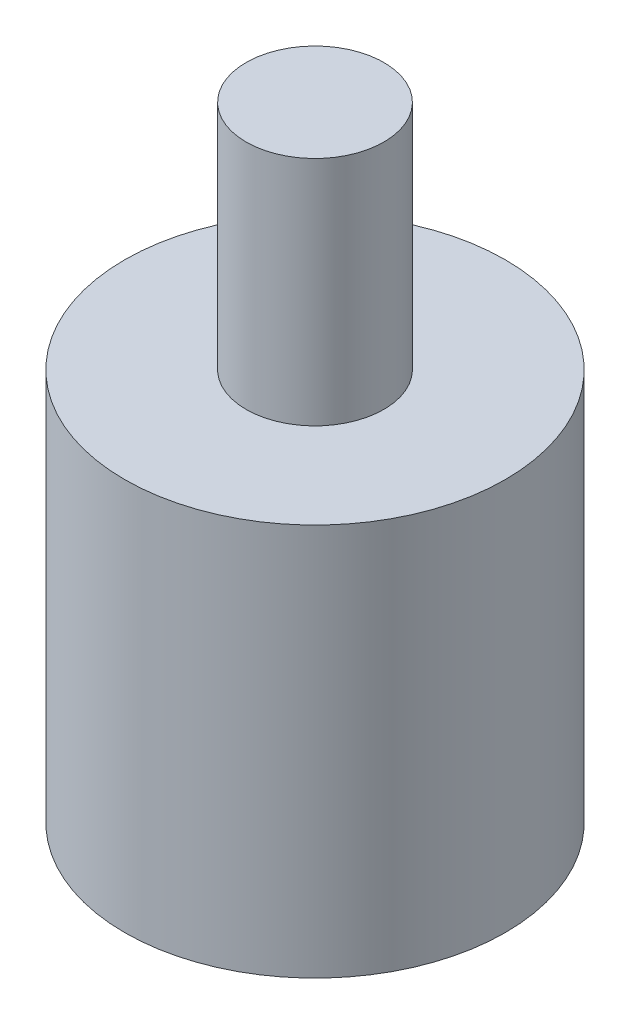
ISO-10303-21;
HEADER;
FILE_DESCRIPTION(('STEP AP214'),'2;1');
FILE_NAME('part.step','',(''),(''),'','','');
FILE_SCHEMA(('AUTOMOTIVE_DESIGN { 1 0 10303 214 1 1 1 1 }'));
ENDSEC;
DATA;
#1=APPLICATION_CONTEXT('core data for automotive mechanical design processes');
#2=APPLICATION_PROTOCOL_DEFINITION('international standard','automotive_design',2000,#1);
#3=PRODUCT_CONTEXT('',#1,'mechanical');
#4=PRODUCT('Part','Part','',(#3));
#5=PRODUCT_RELATED_PRODUCT_CATEGORY('part','',(#4));
#6=PRODUCT_DEFINITION_FORMATION('','',#4);
#7=PRODUCT_DEFINITION_CONTEXT('part definition',#1,'design');
#8=PRODUCT_DEFINITION('design','',#6,#7);
#9=PRODUCT_DEFINITION_SHAPE('','',#8);
#10=(LENGTH_UNIT() NAMED_UNIT(*) SI_UNIT(.MILLI.,.METRE.));
#11=(NAMED_UNIT(*) PLANE_ANGLE_UNIT() SI_UNIT($,.RADIAN.));
#12=(NAMED_UNIT(*) SI_UNIT($,.STERADIAN.) SOLID_ANGLE_UNIT());
#13=UNCERTAINTY_MEASURE_WITH_UNIT(LENGTH_MEASURE(1.E-05),#10,'distance_accuracy_value','');
#14=(GEOMETRIC_REPRESENTATION_CONTEXT(3) GLOBAL_UNCERTAINTY_ASSIGNED_CONTEXT((#13)) GLOBAL_UNIT_ASSIGNED_CONTEXT((#10,
#11,#12)) REPRESENTATION_CONTEXT('',''));
#15=CARTESIAN_POINT('',(0.,0.,0.));
#16=DIRECTION('',(0.,0.,1.));
#17=DIRECTION('',(1.,0.,0.));
#18=AXIS2_PLACEMENT_3D('',#15,#16,#17);
#19=CARTESIAN_POINT('',(0.,20.5,0.));
#20=DIRECTION('',(0.,-1.,0.));
#21=DIRECTION('',(0.,0.,-1.));
#22=AXIS2_PLACEMENT_3D('',#19,#20,#21);
#23=CYLINDRICAL_SURFACE('',#22,9.945);
#24=CARTESIAN_POINT('',(0.,20.5,0.));
#25=DIRECTION('',(0.,1.,0.));
#26=DIRECTION('',(0.,0.,1.));
#27=AXIS2_PLACEMENT_3D('',#24,#25,#26);
#28=CIRCLE('',#27,9.945);
#29=CARTESIAN_POINT('',(0.,20.5,9.945));
#30=VERTEX_POINT('',#29);
#31=EDGE_CURVE('E51',#30,#30,#28,.T.);
#32=ORIENTED_EDGE('',*,*,#31,.F.);
#33=EDGE_LOOP('',(#32));
#34=FACE_BOUND('',#33,.T.);
#35=CARTESIAN_POINT('',(0.,0.,0.));
#36=DIRECTION('',(0.,1.,0.));
#37=DIRECTION('',(0.,0.,1.));
#38=AXIS2_PLACEMENT_3D('',#35,#36,#37);
#39=CIRCLE('',#38,9.945);
#40=CARTESIAN_POINT('',(0.,0.,9.945));
#41=VERTEX_POINT('',#40);
#42=EDGE_CURVE('E46',#41,#41,#39,.T.);
#43=ORIENTED_EDGE('',*,*,#42,.T.);
#44=EDGE_LOOP('',(#43));
#45=FACE_BOUND('',#44,.T.);
#46=ADVANCED_FACE('F43',(#34,#45),#23,.T.);
#47=CARTESIAN_POINT('',(0.,20.5,0.));
#48=DIRECTION('',(0.,1.,0.));
#49=DIRECTION('',(0.,0.,1.));
#50=AXIS2_PLACEMENT_3D('',#47,#48,#49);
#51=PLANE('',#50);
#52=CARTESIAN_POINT('',(0.,20.5,0.));
#53=DIRECTION('',(0.,1.,0.));
#54=DIRECTION('',(0.,0.,1.));
#55=AXIS2_PLACEMENT_3D('',#52,#53,#54);
#56=CIRCLE('',#55,3.6);
#57=CARTESIAN_POINT('',(0.,20.5,3.6));
#58=VERTEX_POINT('',#57);
#59=EDGE_CURVE('E10',#58,#58,#56,.T.);
#60=ORIENTED_EDGE('',*,*,#59,.F.);
#61=EDGE_LOOP('',(#60));
#62=FACE_BOUND('',#61,.T.);
#63=ORIENTED_EDGE('',*,*,#31,.T.);
#64=EDGE_LOOP('',(#63));
#65=FACE_BOUND('',#64,.T.);
#66=ADVANCED_FACE('F71',(#62,#65),#51,.T.);
#67=CARTESIAN_POINT('',(0.,0.,0.));
#68=DIRECTION('',(0.,1.,0.));
#69=DIRECTION('',(0.,0.,1.));
#70=AXIS2_PLACEMENT_3D('',#67,#68,#69);
#71=PLANE('',#70);
#72=ORIENTED_EDGE('',*,*,#42,.F.);
#73=EDGE_LOOP('',(#72));
#74=FACE_BOUND('',#73,.T.);
#75=ADVANCED_FACE('F68',(#74),#71,.F.);
#76=CARTESIAN_POINT('',(0.,32.6,0.));
#77=DIRECTION('',(0.,-1.,0.));
#78=DIRECTION('',(0.,0.,-1.));
#79=AXIS2_PLACEMENT_3D('',#76,#77,#78);
#80=CYLINDRICAL_SURFACE('',#79,3.6);
#81=CARTESIAN_POINT('',(0.,32.6,0.));
#82=DIRECTION('',(0.,1.,0.));
#83=DIRECTION('',(0.,0.,1.));
#84=AXIS2_PLACEMENT_3D('',#81,#82,#83);
#85=CIRCLE('',#84,3.6);
#86=CARTESIAN_POINT('',(0.,32.6,3.6));
#87=VERTEX_POINT('',#86);
#88=EDGE_CURVE('E58',#87,#87,#85,.T.);
#89=ORIENTED_EDGE('',*,*,#88,.F.);
#90=EDGE_LOOP('',(#89));
#91=FACE_BOUND('',#90,.T.);
#92=ORIENTED_EDGE('',*,*,#59,.T.);
#93=EDGE_LOOP('',(#92));
#94=FACE_BOUND('',#93,.T.);
#95=ADVANCED_FACE('F70',(#91,#94),#80,.T.);
#96=CARTESIAN_POINT('',(0.,32.6,0.));
#97=DIRECTION('',(0.,1.,0.));
#98=DIRECTION('',(0.,0.,1.));
#99=AXIS2_PLACEMENT_3D('',#96,#97,#98);
#100=PLANE('',#99);
#101=ORIENTED_EDGE('',*,*,#88,.T.);
#102=EDGE_LOOP('',(#101));
#103=FACE_BOUND('',#102,.T.);
#104=ADVANCED_FACE('F77',(#103),#100,.T.);
#105=CLOSED_SHELL('',(#46,#66,#75,#95,#104));
#106=MANIFOLD_SOLID_BREP('B2',#105);
#107=ADVANCED_BREP_SHAPE_REPRESENTATION('',(#18,#106),#14);
#108=SHAPE_DEFINITION_REPRESENTATION(#9,#107);
ENDSEC;
END-ISO-10303-21;
